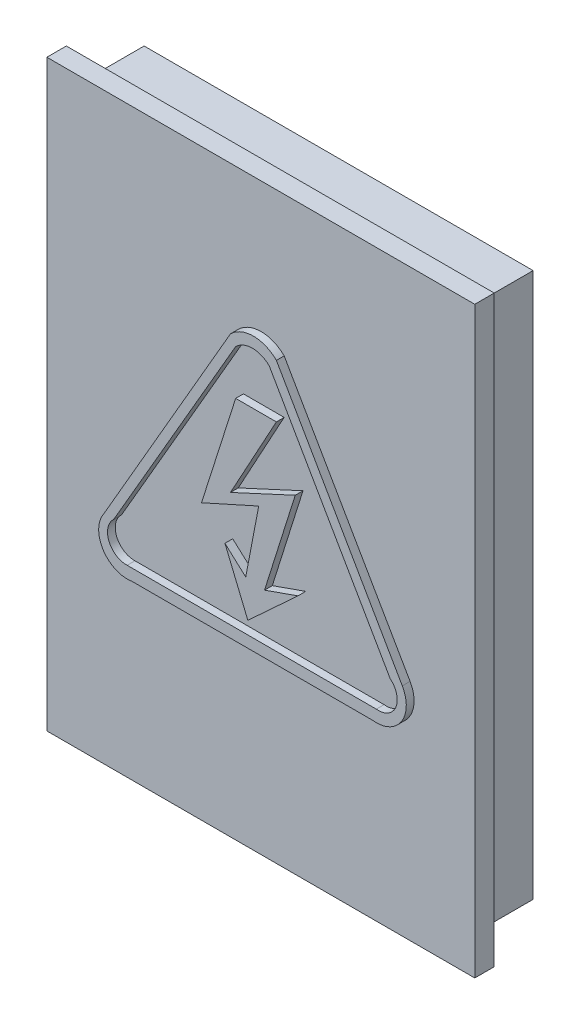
from build123d import *

# Parameters (mm, degrees)
CROQUIS1_W              = 100
CROQUIS1_H              = 140
SALIENTE_EXTRUIR2_DEPTH = 15
CROQUIS3_W              = 110
CROQUIS3_H              = 150
SALIENTE_EXTRUIR4_DEPTH = 5
SALIENTE_EXTRUIR6_DEPTH = 2


with BuildPart() as part:
    # Croquis1 → Saliente-Extruir2 (new body)
    with BuildSketch(Plane.XY):
        Rectangle(CROQUIS1_W, CROQUIS1_H)
    extrude(amount=SALIENTE_EXTRUIR2_DEPTH)

    # Croquis3 → Saliente-Extruir4 (add)
    with BuildSketch(Plane.XY.offset(15)):
        Rectangle(CROQUIS3_W, CROQUIS3_H)
    extrude(amount=SALIENTE_EXTRUIR4_DEPTH)

    # Croquis5 → Saliente-Extruir6 (add)
    # profile 1 of 2: a face of its own
    with BuildSketch(Plane.XY.offset(20)):
        with BuildLine():
            ThreePointArc((-5.801572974, 39.013043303), (0.099496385, 41.457348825), (6.000567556, 39.013047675))
            Line((6.000567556, 39.013047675), (38.37101187, -17.278329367))
            ThreePointArc((38.37101187, -17.278329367), (38.079774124, -25.426361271), (30.634699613, -28.749929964))
            Line((30.634699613, -28.749929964), (-31.161330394, -28.749929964))
            ThreePointArc((-31.161330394, -28.749929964), (-38.571898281, -25.412560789), (-38.342257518, -17.288410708))
            Line((-38.342257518, -17.288410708), (-5.801572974, 39.013043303))
        make_face()
        with BuildLine():
            Line((-35.806590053, -17.288410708), (-4.467998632, 36.846767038))
            ThreePointArc((-4.467998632, 36.846767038), (-0.148601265, 38.635920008), (4.170796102, 36.846767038))
            Line((4.170796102, 36.846767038), (35.279959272, -17.278329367))
            ThreePointArc((35.279959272, -17.278329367), (36.692478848, -22.886854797), (31.69246733, -25.793855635))
            Line((31.69246733, -25.793855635), (-32.363323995, -25.793855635))
            ThreePointArc((-32.363323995, -25.793855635), (-37.061690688, -22.746206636), (-35.806590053, -17.288410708))
        make_face(mode=Mode.SUBTRACT)
    # profile 2 of 2: a face of its own
    with BuildSketch(Plane.XY.offset(20)):
        Polygon((-13.251998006, -2.317202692), (-4.467998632, 25.314337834), (6.000559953, 25.314337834), (-5.801572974, 3.710433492), (10.843225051, 11.401828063), (2.953043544, -13.671166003), (11.549002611, -10.646019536), (-1.338602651, -22.536220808), (-7.226660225, -8.32667295), (-1.881118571, -13.164167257), (1.457767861, 4.302952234), align=None)
    extrude(amount=SALIENTE_EXTRUIR6_DEPTH)


solid = part.part
